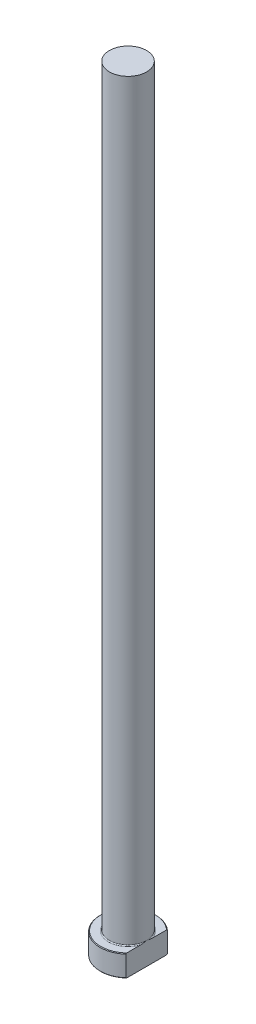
from build123d import *
from build123d.topology import SkipClean

# Parameters (mm, degrees)
CHAMFER1_SIZE = 0.2
FILLET1_R     = 0.3
KEY_DEPTH     = 251.32379032


with BuildPart() as part:
    # Sketch1 → Revolve1 (revolve)
    with BuildSketch(Plane.XY, mode=Mode.PRIVATE) as revolve1_sk:
        Polygon((0, 0), (-9, 0), (-9, 7), (-6, 7), (-6, 250), (0, 250), align=None)
    revolve(revolve1_sk.sketch.rotate(Axis((0, 259.958771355, 0), (0, -1, 0)), 270), axis=Axis((0, 259.958771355, 0), (0, -1, 0)))

    # Chamfer1
    chamfer1_edges = [part.edges().sort_by_distance(p)[0] for p in [
        (0, 7, -9),
        (0, 0, -9),
    ]]
    chamfer(chamfer1_edges, length=CHAMFER1_SIZE)

    # Fillet1
    fillet1_edges = [part.edges().sort_by_distance(p)[0] for p in [
        (0, 7, -6),
    ]]
    fillet(fillet1_edges, radius=FILLET1_R)

    # Sketch2 → KEY (cut, through all)
    with SkipClean():  # the faces are left unmerged after this step: merging them gives an invalid solid
        with BuildSketch(Plane(origin=(0, 0, 0), x_dir=(1, 0, 0), z_dir=(0, 1, 0))):
            with BuildLine():
                Line((6, 6.708203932), (6, -6.708203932))
                ThreePointArc((6, -6.708203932), (9, 0), (6, 6.708203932))
            make_face()
        extrude(amount=KEY_DEPTH, mode=Mode.SUBTRACT)


solid = part.part
